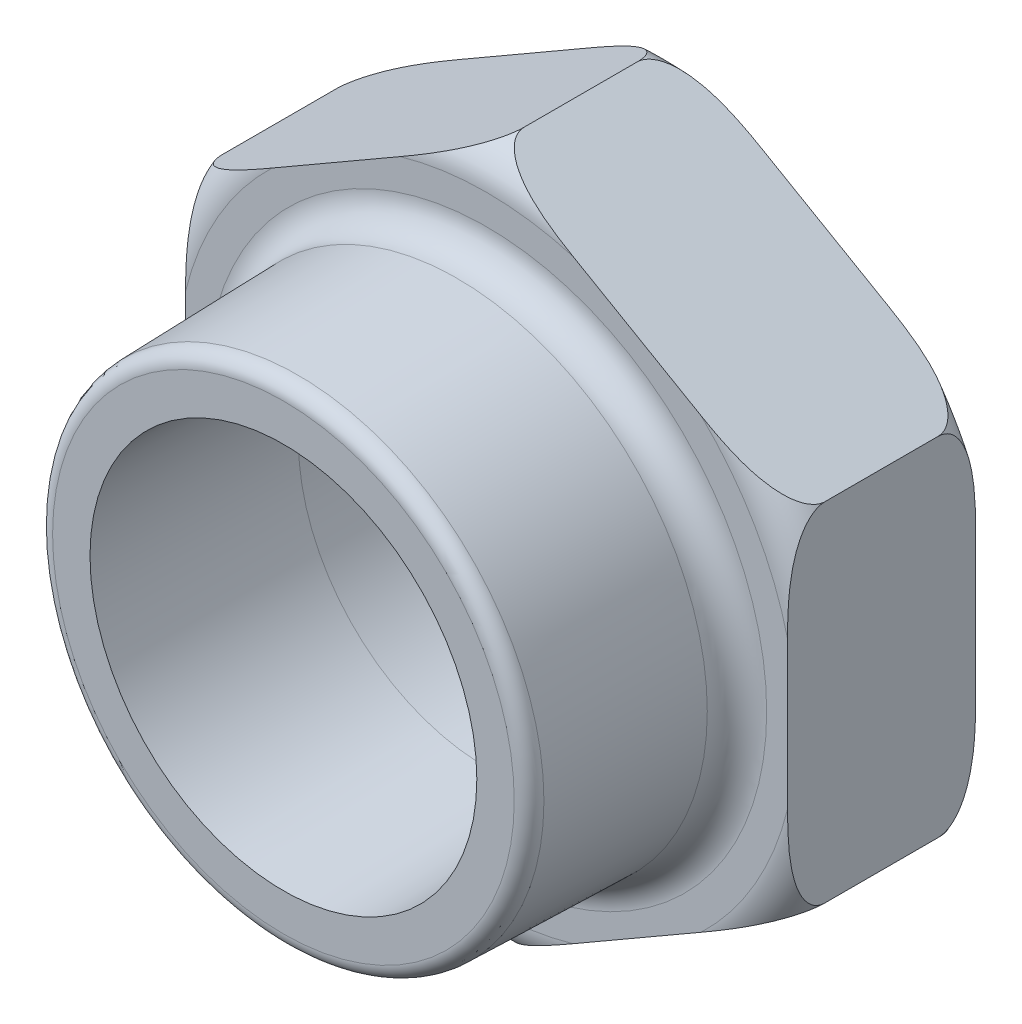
from build123d import *

# Parameters (mm, degrees)
TETE_DEPTH                 = 2.5
ESQUISSE3_R                = 2.5
ENL_V_DE_MAT_EXTRU_1_DEPTH = 7.601767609
ESQUISSE4_R                = 3.333333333
ESQUISSE4_R_2              = 2.5
BOSS_EXTRU_1_DEPTH         = 2.7
BOSS_EXTRU_1_DRAFT         = 1.499999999
CONG_1_R                   = 0.4
CONG_3_R                   = 0.2


with BuildPart() as part:
    # Esquisse1 → Tete (new body)
    with BuildSketch(Plane.XY):
        Polygon((-4, 2.309401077), (-4, -2.309401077), (0, -4.618802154), (4, -2.309401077), (4, 2.309401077), (0, 4.618802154), align=None)
    extrude(amount=TETE_DEPTH)

    # Esquisse2 → Rayon de tete (revolve, cut)
    with BuildSketch(Plane(origin=(0, 0, 0), x_dir=(0, 0, -1), z_dir=(1, 0, 0))):
        with BuildLine():
            Line((-0.5, -4.618802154), (-0.5, -14.618802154))
            Line((-0.5, -14.618802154), (8.771054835, -14.618802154))
            Line((8.771054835, -14.618802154), (8.771054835, -4.118802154))
            Line((8.771054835, -4.118802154), (0, -4.118802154))
            ThreePointArc((0, -4.118802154), (-0.146446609, -4.472355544), (-0.5, -4.618802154))
        make_face()
    rayon_de_tete = revolve(axis=Axis((0, 0, 0), (0, 0, 1)), mode=Mode.SUBTRACT)

    # Sym_trie1: Rayon de tete across plane
    add(rayon_de_tete.mirror(Plane.XY.offset(1.25)), mode=Mode.SUBTRACT)

    # Esquisse3 → Enl_v. de mat.-Extru.1 (cut, through all)
    with BuildSketch(Plane(origin=(0, 0, 0), x_dir=(-1, 0, 0), z_dir=(0, 0, -1))):
        Circle(ESQUISSE3_R)
    extrude(amount=-ENL_V_DE_MAT_EXTRU_1_DEPTH, mode=Mode.SUBTRACT)


with BuildPart() as boss_extru_1_tool:
    # Esquisse4 → Boss.-Extru.1 (with draft: the straight prism first)
    with BuildSketch(Plane.XY.offset(2.5)):
        Circle(ESQUISSE4_R)
        with Locations(Location((0, 0, 0), (0, 0, 180))):
            Circle(ESQUISSE4_R_2, mode=Mode.SUBTRACT)
    extrude(amount=BOSS_EXTRU_1_DEPTH)
    # Boss.-Extru.1: the draft: its side faces are tilted about the plane it starts from
    boss_extru_1_sides = [boss_extru_1_tool.faces().sort_by_distance(p)[0] for p in [
        (-3.333333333, 0, 3.85),
        (2.5, 0, 3.85),
    ]]
    draft(boss_extru_1_sides, Plane.XY.offset(2.5), BOSS_EXTRU_1_DRAFT)


with BuildPart() as part_1:
    add(part.part)

    # Boss.-Extru.1: add boss_extru_1_tool
    add(boss_extru_1_tool.part)

    # Cong_1
    cong_1_edges = [part_1.edges().sort_by_distance(p)[0] for p in [
        (-3.333333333, 0, 2.5),
    ]]
    fillet(cong_1_edges, radius=CONG_1_R)

    # Cong_3
    cong_3_edges = [part_1.edges().sort_by_distance(p)[0] for p in [
        (-3.262631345, 0, 5.2),
    ]]
    fillet(cong_3_edges, radius=CONG_3_R)


solid = part_1.part
